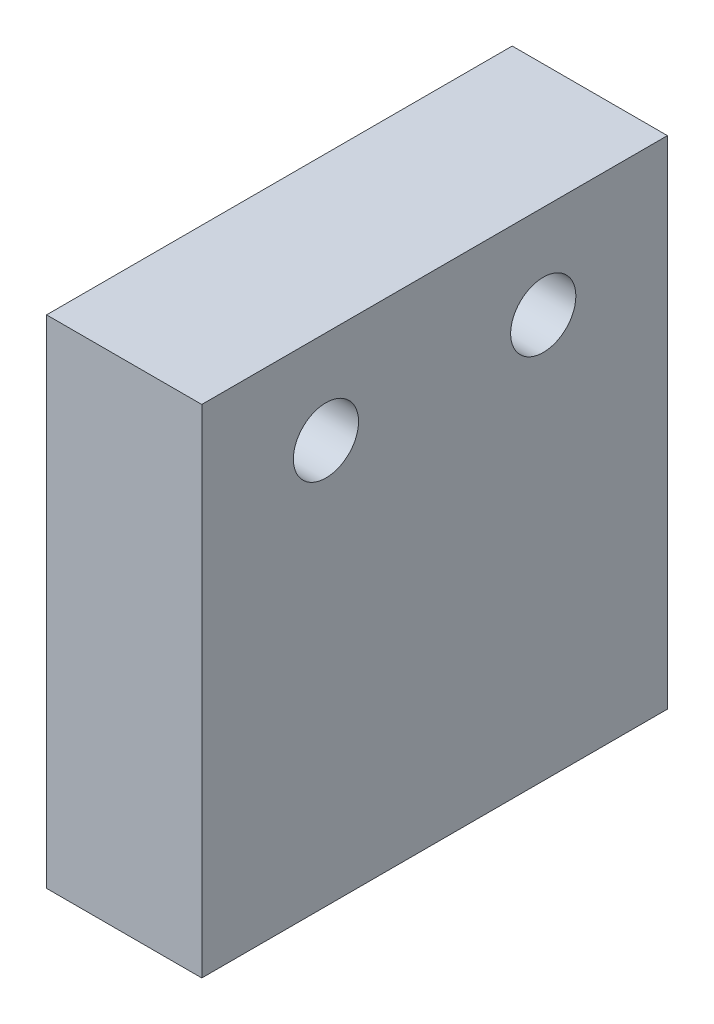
ISO-10303-21;
HEADER;
FILE_DESCRIPTION(('STEP AP214'),'2;1');
FILE_NAME('part.step','',(''),(''),'','','');
FILE_SCHEMA(('AUTOMOTIVE_DESIGN { 1 0 10303 214 1 1 1 1 }'));
ENDSEC;
DATA;
#1=APPLICATION_CONTEXT('core data for automotive mechanical design processes');
#2=APPLICATION_PROTOCOL_DEFINITION('international standard','automotive_design',2000,#1);
#3=PRODUCT_CONTEXT('',#1,'mechanical');
#4=PRODUCT('Part','Part','',(#3));
#5=PRODUCT_RELATED_PRODUCT_CATEGORY('part','',(#4));
#6=PRODUCT_DEFINITION_FORMATION('','',#4);
#7=PRODUCT_DEFINITION_CONTEXT('part definition',#1,'design');
#8=PRODUCT_DEFINITION('design','',#6,#7);
#9=PRODUCT_DEFINITION_SHAPE('','',#8);
#10=(LENGTH_UNIT() NAMED_UNIT(*) SI_UNIT(.MILLI.,.METRE.));
#11=(NAMED_UNIT(*) PLANE_ANGLE_UNIT() SI_UNIT($,.RADIAN.));
#12=(NAMED_UNIT(*) SI_UNIT($,.STERADIAN.) SOLID_ANGLE_UNIT());
#13=UNCERTAINTY_MEASURE_WITH_UNIT(LENGTH_MEASURE(1.E-05),#10,'distance_accuracy_value','');
#14=(GEOMETRIC_REPRESENTATION_CONTEXT(3) GLOBAL_UNCERTAINTY_ASSIGNED_CONTEXT((#13)) GLOBAL_UNIT_ASSIGNED_CONTEXT((#10,
#11,#12)) REPRESENTATION_CONTEXT('',''));
#15=CARTESIAN_POINT('',(0.,0.,0.));
#16=DIRECTION('',(0.,0.,1.));
#17=DIRECTION('',(1.,0.,0.));
#18=AXIS2_PLACEMENT_3D('',#15,#16,#17);
#19=CARTESIAN_POINT('',(0.,0.,30.));
#20=DIRECTION('',(0.,1.,0.));
#21=DIRECTION('',(0.,0.,1.));
#22=AXIS2_PLACEMENT_3D('',#19,#20,#21);
#23=PLANE('',#22);
#24=CARTESIAN_POINT('',(5.,0.,5.));
#25=DIRECTION('',(0.,-1.,0.));
#26=DIRECTION('',(0.,0.,-1.));
#27=AXIS2_PLACEMENT_3D('',#24,#25,#26);
#28=CIRCLE('',#27,2.5);
#29=CARTESIAN_POINT('',(5.,0.,2.5));
#30=VERTEX_POINT('',#29);
#31=EDGE_CURVE('E126',#30,#30,#28,.T.);
#32=ORIENTED_EDGE('',*,*,#31,.F.);
#33=EDGE_LOOP('',(#32));
#34=FACE_BOUND('',#33,.T.);
#35=CARTESIAN_POINT('',(5.,0.,25.));
#36=DIRECTION('',(0.,-1.,0.));
#37=DIRECTION('',(0.,0.,-1.));
#38=AXIS2_PLACEMENT_3D('',#35,#36,#37);
#39=CIRCLE('',#38,2.5);
#40=CARTESIAN_POINT('',(5.,0.,22.5));
#41=VERTEX_POINT('',#40);
#42=EDGE_CURVE('E120',#41,#41,#39,.T.);
#43=ORIENTED_EDGE('',*,*,#42,.F.);
#44=EDGE_LOOP('',(#43));
#45=FACE_BOUND('',#44,.T.);
#46=DIRECTION('',(1.,0.,0.));
#47=VECTOR('',#46,1.);
#48=CARTESIAN_POINT('',(0.,0.,0.));
#49=LINE('',#48,#47);
#50=CARTESIAN_POINT('',(0.,0.,0.));
#51=VERTEX_POINT('',#50);
#52=CARTESIAN_POINT('',(10.,0.,0.));
#53=VERTEX_POINT('',#52);
#54=EDGE_CURVE('E98',#51,#53,#49,.T.);
#55=ORIENTED_EDGE('',*,*,#54,.T.);
#56=DIRECTION('',(0.,0.,-1.));
#57=VECTOR('',#56,1.);
#58=CARTESIAN_POINT('',(10.,0.,30.));
#59=LINE('',#58,#57);
#60=CARTESIAN_POINT('',(10.,0.,30.));
#61=VERTEX_POINT('',#60);
#62=EDGE_CURVE('E11',#61,#53,#59,.T.);
#63=ORIENTED_EDGE('',*,*,#62,.F.);
#64=DIRECTION('',(1.,0.,0.));
#65=VECTOR('',#64,1.);
#66=CARTESIAN_POINT('',(0.,0.,30.));
#67=LINE('',#66,#65);
#68=CARTESIAN_POINT('',(0.,0.,30.));
#69=VERTEX_POINT('',#68);
#70=EDGE_CURVE('E85',#69,#61,#67,.T.);
#71=ORIENTED_EDGE('',*,*,#70,.F.);
#72=DIRECTION('',(0.,0.,-1.));
#73=VECTOR('',#72,1.);
#74=CARTESIAN_POINT('',(0.,0.,30.));
#75=LINE('',#74,#73);
#76=EDGE_CURVE('E94',#69,#51,#75,.T.);
#77=ORIENTED_EDGE('',*,*,#76,.T.);
#78=EDGE_LOOP('',(#55,#63,#71,#77));
#79=FACE_BOUND('',#78,.T.);
#80=ADVANCED_FACE('F32',(#34,#45,#79),#23,.F.);
#81=CARTESIAN_POINT('',(10.,0.,30.));
#82=DIRECTION('',(-1.,0.,0.));
#83=DIRECTION('',(0.,0.,1.));
#84=AXIS2_PLACEMENT_3D('',#81,#82,#83);
#85=PLANE('',#84);
#86=CARTESIAN_POINT('',(10.,25.9999999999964,8.));
#87=DIRECTION('',(1.,0.,0.));
#88=DIRECTION('',(0.,0.,-1.));
#89=AXIS2_PLACEMENT_3D('',#86,#87,#88);
#90=CIRCLE('',#89,2.09999999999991);
#91=CARTESIAN_POINT('',(10.,25.9999999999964,5.90000000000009));
#92=VERTEX_POINT('',#91);
#93=EDGE_CURVE('E115',#92,#92,#90,.T.);
#94=ORIENTED_EDGE('',*,*,#93,.F.);
#95=EDGE_LOOP('',(#94));
#96=FACE_BOUND('',#95,.T.);
#97=CARTESIAN_POINT('',(10.,25.9999999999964,22.));
#98=DIRECTION('',(1.,0.,0.));
#99=DIRECTION('',(0.,0.,-1.));
#100=AXIS2_PLACEMENT_3D('',#97,#98,#99);
#101=CIRCLE('',#100,2.09999999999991);
#102=CARTESIAN_POINT('',(10.,25.9999999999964,19.9000000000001));
#103=VERTEX_POINT('',#102);
#104=EDGE_CURVE('E107',#103,#103,#101,.T.);
#105=ORIENTED_EDGE('',*,*,#104,.F.);
#106=EDGE_LOOP('',(#105));
#107=FACE_BOUND('',#106,.T.);
#108=DIRECTION('',(0.,1.,0.));
#109=VECTOR('',#108,1.);
#110=CARTESIAN_POINT('',(10.,0.,0.));
#111=LINE('',#110,#109);
#112=CARTESIAN_POINT('',(10.,32.,0.));
#113=VERTEX_POINT('',#112);
#114=EDGE_CURVE('E89',#53,#113,#111,.T.);
#115=ORIENTED_EDGE('',*,*,#114,.T.);
#116=DIRECTION('',(0.,0.,-1.));
#117=VECTOR('',#116,1.);
#118=CARTESIAN_POINT('',(10.,32.,30.));
#119=LINE('',#118,#117);
#120=CARTESIAN_POINT('',(10.,32.,30.));
#121=VERTEX_POINT('',#120);
#122=EDGE_CURVE('E41',#121,#113,#119,.T.);
#123=ORIENTED_EDGE('',*,*,#122,.F.);
#124=DIRECTION('',(0.,1.,0.));
#125=VECTOR('',#124,1.);
#126=CARTESIAN_POINT('',(10.,0.,30.));
#127=LINE('',#126,#125);
#128=EDGE_CURVE('E80',#61,#121,#127,.T.);
#129=ORIENTED_EDGE('',*,*,#128,.F.);
#130=ORIENTED_EDGE('',*,*,#62,.T.);
#131=EDGE_LOOP('',(#115,#123,#129,#130));
#132=FACE_BOUND('',#131,.T.);
#133=ADVANCED_FACE('F88',(#96,#107,#132),#85,.F.);
#134=CARTESIAN_POINT('',(0.,32.,30.));
#135=DIRECTION('',(0.,-1.,0.));
#136=DIRECTION('',(0.,0.,-1.));
#137=AXIS2_PLACEMENT_3D('',#134,#135,#136);
#138=PLANE('',#137);
#139=DIRECTION('',(-1.,0.,0.));
#140=VECTOR('',#139,1.);
#141=CARTESIAN_POINT('',(0.,32.,0.));
#142=LINE('',#141,#140);
#143=CARTESIAN_POINT('',(0.,32.,0.));
#144=VERTEX_POINT('',#143);
#145=EDGE_CURVE('E67',#113,#144,#142,.T.);
#146=ORIENTED_EDGE('',*,*,#145,.T.);
#147=DIRECTION('',(0.,0.,-1.));
#148=VECTOR('',#147,1.);
#149=CARTESIAN_POINT('',(0.,32.,30.));
#150=LINE('',#149,#148);
#151=CARTESIAN_POINT('',(0.,32.,30.));
#152=VERTEX_POINT('',#151);
#153=EDGE_CURVE('E90',#152,#144,#150,.T.);
#154=ORIENTED_EDGE('',*,*,#153,.F.);
#155=DIRECTION('',(-1.,0.,0.));
#156=VECTOR('',#155,1.);
#157=CARTESIAN_POINT('',(0.,32.,30.));
#158=LINE('',#157,#156);
#159=EDGE_CURVE('E83',#121,#152,#158,.T.);
#160=ORIENTED_EDGE('',*,*,#159,.F.);
#161=ORIENTED_EDGE('',*,*,#122,.T.);
#162=EDGE_LOOP('',(#146,#154,#160,#161));
#163=FACE_BOUND('',#162,.T.);
#164=ADVANCED_FACE('F92',(#163),#138,.F.);
#165=CARTESIAN_POINT('',(0.,0.,30.));
#166=DIRECTION('',(1.,0.,0.));
#167=DIRECTION('',(0.,0.,-1.));
#168=AXIS2_PLACEMENT_3D('',#165,#166,#167);
#169=PLANE('',#168);
#170=CARTESIAN_POINT('',(0.,25.9999999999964,8.));
#171=DIRECTION('',(1.,0.,0.));
#172=DIRECTION('',(0.,0.,-1.));
#173=AXIS2_PLACEMENT_3D('',#170,#171,#172);
#174=CIRCLE('',#173,2.09999999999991);
#175=CARTESIAN_POINT('',(0.,25.9999999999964,5.90000000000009));
#176=VERTEX_POINT('',#175);
#177=EDGE_CURVE('E35',#176,#176,#174,.T.);
#178=ORIENTED_EDGE('',*,*,#177,.T.);
#179=EDGE_LOOP('',(#178));
#180=FACE_BOUND('',#179,.T.);
#181=CARTESIAN_POINT('',(0.,25.9999999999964,22.));
#182=DIRECTION('',(1.,0.,0.));
#183=DIRECTION('',(0.,0.,-1.));
#184=AXIS2_PLACEMENT_3D('',#181,#182,#183);
#185=CIRCLE('',#184,2.09999999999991);
#186=CARTESIAN_POINT('',(0.,25.9999999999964,19.9000000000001));
#187=VERTEX_POINT('',#186);
#188=EDGE_CURVE('E101',#187,#187,#185,.T.);
#189=ORIENTED_EDGE('',*,*,#188,.T.);
#190=EDGE_LOOP('',(#189));
#191=FACE_BOUND('',#190,.T.);
#192=DIRECTION('',(0.,-1.,0.));
#193=VECTOR('',#192,1.);
#194=CARTESIAN_POINT('',(0.,0.,0.));
#195=LINE('',#194,#193);
#196=EDGE_CURVE('E73',#144,#51,#195,.T.);
#197=ORIENTED_EDGE('',*,*,#196,.T.);
#198=ORIENTED_EDGE('',*,*,#76,.F.);
#199=DIRECTION('',(0.,-1.,0.));
#200=VECTOR('',#199,1.);
#201=CARTESIAN_POINT('',(0.,0.,30.));
#202=LINE('',#201,#200);
#203=EDGE_CURVE('E50',#152,#69,#202,.T.);
#204=ORIENTED_EDGE('',*,*,#203,.F.);
#205=ORIENTED_EDGE('',*,*,#153,.T.);
#206=EDGE_LOOP('',(#197,#198,#204,#205));
#207=FACE_BOUND('',#206,.T.);
#208=ADVANCED_FACE('F157',(#180,#191,#207),#169,.F.);
#209=CARTESIAN_POINT('',(10.,0.,30.));
#210=DIRECTION('',(0.,0.,1.));
#211=DIRECTION('',(1.,0.,0.));
#212=AXIS2_PLACEMENT_3D('',#209,#210,#211);
#213=PLANE('',#212);
#214=ORIENTED_EDGE('',*,*,#70,.T.);
#215=ORIENTED_EDGE('',*,*,#128,.T.);
#216=ORIENTED_EDGE('',*,*,#159,.T.);
#217=ORIENTED_EDGE('',*,*,#203,.T.);
#218=EDGE_LOOP('',(#214,#215,#216,#217));
#219=FACE_BOUND('',#218,.T.);
#220=ADVANCED_FACE('F81',(#219),#213,.T.);
#221=CARTESIAN_POINT('',(10.,0.,0.));
#222=DIRECTION('',(0.,0.,1.));
#223=DIRECTION('',(1.,0.,0.));
#224=AXIS2_PLACEMENT_3D('',#221,#222,#223);
#225=PLANE('',#224);
#226=ORIENTED_EDGE('',*,*,#54,.F.);
#227=ORIENTED_EDGE('',*,*,#196,.F.);
#228=ORIENTED_EDGE('',*,*,#145,.F.);
#229=ORIENTED_EDGE('',*,*,#114,.F.);
#230=EDGE_LOOP('',(#226,#227,#228,#229));
#231=FACE_BOUND('',#230,.T.);
#232=ADVANCED_FACE('F147',(#231),#225,.F.);
#233=CARTESIAN_POINT('',(-20.,25.9999999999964,22.));
#234=DIRECTION('',(1.,0.,0.));
#235=DIRECTION('',(0.,0.,-1.));
#236=AXIS2_PLACEMENT_3D('',#233,#234,#235);
#237=CYLINDRICAL_SURFACE('',#236,2.09999999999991);
#238=ORIENTED_EDGE('',*,*,#104,.T.);
#239=EDGE_LOOP('',(#238));
#240=FACE_BOUND('',#239,.T.);
#241=ORIENTED_EDGE('',*,*,#188,.F.);
#242=EDGE_LOOP('',(#241));
#243=FACE_BOUND('',#242,.T.);
#244=ADVANCED_FACE('F149',(#240,#243),#237,.F.);
#245=CARTESIAN_POINT('',(-20.,25.9999999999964,8.));
#246=DIRECTION('',(1.,0.,0.));
#247=DIRECTION('',(0.,0.,-1.));
#248=AXIS2_PLACEMENT_3D('',#245,#246,#247);
#249=CYLINDRICAL_SURFACE('',#248,2.09999999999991);
#250=ORIENTED_EDGE('',*,*,#93,.T.);
#251=EDGE_LOOP('',(#250));
#252=FACE_BOUND('',#251,.T.);
#253=ORIENTED_EDGE('',*,*,#177,.F.);
#254=EDGE_LOOP('',(#253));
#255=FACE_BOUND('',#254,.T.);
#256=ADVANCED_FACE('F155',(#252,#255),#249,.F.);
#257=CARTESIAN_POINT('',(5.,12.,25.));
#258=DIRECTION('',(0.,-1.,0.));
#259=DIRECTION('',(0.,0.,-1.));
#260=AXIS2_PLACEMENT_3D('',#257,#258,#259);
#261=CYLINDRICAL_SURFACE('',#260,2.5);
#262=CARTESIAN_POINT('',(5.,12.,25.));
#263=DIRECTION('',(0.,-1.,0.));
#264=DIRECTION('',(0.,0.,-1.));
#265=AXIS2_PLACEMENT_3D('',#262,#263,#264);
#266=CIRCLE('',#265,2.5);
#267=CARTESIAN_POINT('',(5.,12.,22.5));
#268=VERTEX_POINT('',#267);
#269=EDGE_CURVE('E119',#268,#268,#266,.T.);
#270=ORIENTED_EDGE('',*,*,#269,.F.);
#271=EDGE_LOOP('',(#270));
#272=FACE_BOUND('',#271,.T.);
#273=ORIENTED_EDGE('',*,*,#42,.T.);
#274=EDGE_LOOP('',(#273));
#275=FACE_BOUND('',#274,.T.);
#276=ADVANCED_FACE('F173',(#272,#275),#261,.F.);
#277=CARTESIAN_POINT('',(5.,12.,25.));
#278=DIRECTION('',(0.,-1.,0.));
#279=DIRECTION('',(0.,0.,-1.));
#280=AXIS2_PLACEMENT_3D('',#277,#278,#279);
#281=PLANE('',#280);
#282=ORIENTED_EDGE('',*,*,#269,.T.);
#283=EDGE_LOOP('',(#282));
#284=FACE_BOUND('',#283,.T.);
#285=ADVANCED_FACE('F137',(#284),#281,.T.);
#286=CARTESIAN_POINT('',(5.,12.,5.));
#287=DIRECTION('',(0.,-1.,0.));
#288=DIRECTION('',(0.,0.,-1.));
#289=AXIS2_PLACEMENT_3D('',#286,#287,#288);
#290=CYLINDRICAL_SURFACE('',#289,2.5);
#291=CARTESIAN_POINT('',(5.,12.,5.));
#292=DIRECTION('',(0.,-1.,0.));
#293=DIRECTION('',(0.,0.,-1.));
#294=AXIS2_PLACEMENT_3D('',#291,#292,#293);
#295=CIRCLE('',#294,2.5);
#296=CARTESIAN_POINT('',(5.,12.,2.5));
#297=VERTEX_POINT('',#296);
#298=EDGE_CURVE('E123',#297,#297,#295,.T.);
#299=ORIENTED_EDGE('',*,*,#298,.F.);
#300=EDGE_LOOP('',(#299));
#301=FACE_BOUND('',#300,.T.);
#302=ORIENTED_EDGE('',*,*,#31,.T.);
#303=EDGE_LOOP('',(#302));
#304=FACE_BOUND('',#303,.T.);
#305=ADVANCED_FACE('F134',(#301,#304),#290,.F.);
#306=CARTESIAN_POINT('',(5.,12.,5.));
#307=DIRECTION('',(0.,-1.,0.));
#308=DIRECTION('',(0.,0.,-1.));
#309=AXIS2_PLACEMENT_3D('',#306,#307,#308);
#310=PLANE('',#309);
#311=ORIENTED_EDGE('',*,*,#298,.T.);
#312=EDGE_LOOP('',(#311));
#313=FACE_BOUND('',#312,.T.);
#314=ADVANCED_FACE('F132',(#313),#310,.T.);
#315=CLOSED_SHELL('',(#80,#133,#164,#208,#220,#232,#244,#256,#276,#285,#305,#314));
#316=MANIFOLD_SOLID_BREP('B2',#315);
#317=ADVANCED_BREP_SHAPE_REPRESENTATION('',(#18,#316),#14);
#318=SHAPE_DEFINITION_REPRESENTATION(#9,#317);
ENDSEC;
END-ISO-10303-21;
